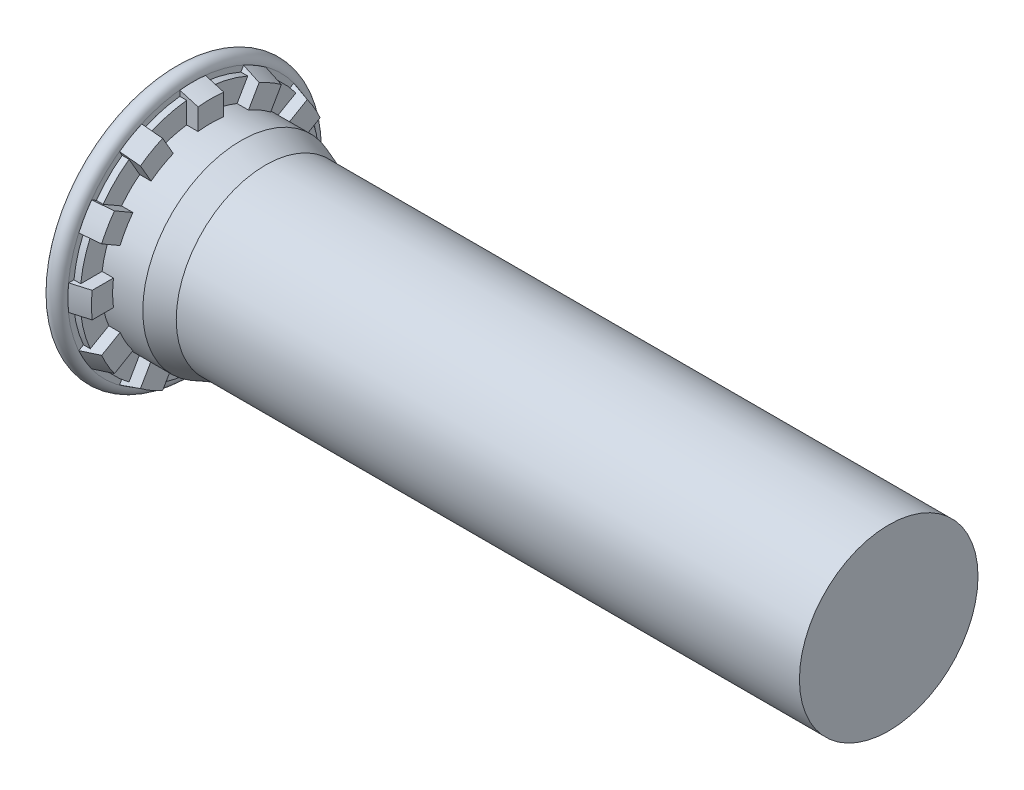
from build123d import *

# Parameters (mm, degrees)
RIBCUT1_DEPTH    = 0.31875
RIBCUT2_DEPTH    = 0.51
RIBCUTSPAT_COUNT = 12
RIBCUTSPAT_ANGLE = 330


with BuildPart() as part:
    # BodySke → BaseBody (revolve)
    with BuildSketch(Plane.XY, mode=Mode.PRIVATE) as basebody_sk:
        with BuildLine():
            Line((0, 0), (0, 3.49246))
            Line((0, 3.49246), (0.00508, 3.49246))
            Line((0.00508, 3.49246), (0.00508, 3.49754))
            ThreePointArc((0.00508, 3.49754), (0.25754, 3.75), (0.51, 3.49754))
            Line((0.51, 3.49754), (0.51, 3.4925))
            Line((0.51, 3.4925), (1.02, 3.343625))
            Line((1.02, 3.343625), (1.02, 2.75))
            Line((1.02, 2.75), (1.863130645, 2.75))
            Line((1.863130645, 2.75), (2.55, 2.5))
            Line((2.55, 2.5), (20, 2.5))
            Line((20, 2.5), (20, 0))
            Line((20, 0), (0, 0))
        make_face()
    revolve(basebody_sk.sketch.rotate(Axis((0, 0, 0), (1, 0, 0)), 90), axis=Axis((0, 0, 0), (1, 0, 0)))

    # RibCut1Ske → RibCut1 (cut)
    with BuildSketch(Plane(origin=(1.02, 0, 0), x_dir=(0, 0, -1), z_dir=(1, 0, 0))):
        with BuildLine():
            Line((0.358947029, 2.726473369), (0.358947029, 3.732781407))
            ThreePointArc((0.358947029, 3.732781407), (0.970571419, 3.622221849), (1.555533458, 3.412157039))
            Line((1.555533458, 3.412157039), (1.052379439, 2.540668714))
            ThreePointArc((1.052379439, 2.540668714), (0.711752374, 2.656296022), (0.358947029, 2.726473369))
        make_face()
    ribcut1 = extrude(amount=-RIBCUT1_DEPTH, mode=Mode.SUBTRACT)

    # RibCut2Ske → RibCut2 (cut)
    with BuildSketch(Plane(origin=(1.02, 0, 0), x_dir=(0, 0, -1), z_dir=(1, 0, 0))):
        with BuildLine():
            Line((0.358947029, 3.324302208), (0.358947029, 3.732781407))
            ThreePointArc((0.358947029, 3.732781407), (0.970571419, 3.622221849), (1.555533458, 3.412157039))
            Line((1.555533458, 3.412157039), (1.351293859, 3.058403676))
            ThreePointArc((1.351293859, 3.058403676), (0.86539383, 3.229693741), (0.358947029, 3.324302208))
        make_face()
    ribcut2 = extrude(amount=-RIBCUT2_DEPTH, mode=Mode.SUBTRACT)

    # RibCutsPat: RibCut1, RibCut2 ×12 about axis
    ribcutspat_axis = Axis((0, 0, 0), (1, 0, 0))
    add([ribcut1.rotate(ribcutspat_axis, i * RIBCUTSPAT_ANGLE / (RIBCUTSPAT_COUNT - 1)) for i in range(1, RIBCUTSPAT_COUNT)], mode=Mode.SUBTRACT)
    add([ribcut2.rotate(ribcutspat_axis, i * RIBCUTSPAT_ANGLE / (RIBCUTSPAT_COUNT - 1)) for i in range(1, RIBCUTSPAT_COUNT)], mode=Mode.SUBTRACT)


solid = part.part
